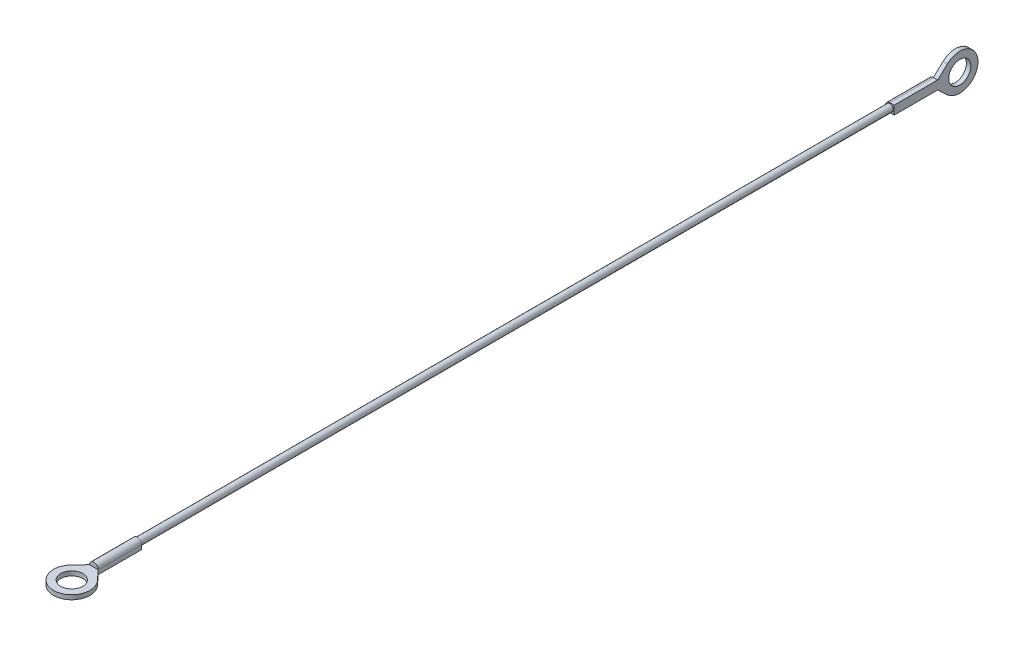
ISO-10303-21;
HEADER;
FILE_DESCRIPTION(('STEP AP214'),'2;1');
FILE_NAME('part.step','',(''),(''),'','','');
FILE_SCHEMA(('AUTOMOTIVE_DESIGN { 1 0 10303 214 1 1 1 1 }'));
ENDSEC;
DATA;
#1=APPLICATION_CONTEXT('core data for automotive mechanical design processes');
#2=APPLICATION_PROTOCOL_DEFINITION('international standard','automotive_design',2000,#1);
#3=PRODUCT_CONTEXT('',#1,'mechanical');
#4=PRODUCT('Part','Part','',(#3));
#5=PRODUCT_RELATED_PRODUCT_CATEGORY('part','',(#4));
#6=PRODUCT_DEFINITION_FORMATION('','',#4);
#7=PRODUCT_DEFINITION_CONTEXT('part definition',#1,'design');
#8=PRODUCT_DEFINITION('design','',#6,#7);
#9=PRODUCT_DEFINITION_SHAPE('','',#8);
#10=(LENGTH_UNIT() NAMED_UNIT(*) SI_UNIT(.MILLI.,.METRE.));
#11=(NAMED_UNIT(*) PLANE_ANGLE_UNIT() SI_UNIT($,.RADIAN.));
#12=(NAMED_UNIT(*) SI_UNIT($,.STERADIAN.) SOLID_ANGLE_UNIT());
#13=UNCERTAINTY_MEASURE_WITH_UNIT(LENGTH_MEASURE(1.E-05),#10,'distance_accuracy_value','');
#14=(GEOMETRIC_REPRESENTATION_CONTEXT(3) GLOBAL_UNCERTAINTY_ASSIGNED_CONTEXT((#13)) GLOBAL_UNIT_ASSIGNED_CONTEXT((#10,
#11,#12)) REPRESENTATION_CONTEXT('',''));
#15=CARTESIAN_POINT('',(0.,0.,0.));
#16=DIRECTION('',(0.,0.,1.));
#17=DIRECTION('',(1.,0.,0.));
#18=AXIS2_PLACEMENT_3D('',#15,#16,#17);
#19=CARTESIAN_POINT('',(0.,0.,-96.52));
#20=DIRECTION('',(0.,0.,-1.));
#21=DIRECTION('',(-1.,0.,0.));
#22=AXIS2_PLACEMENT_3D('',#19,#20,#21);
#23=PLANE('',#22);
#24=CARTESIAN_POINT('',(0.,-0.995,-96.52));
#25=CARTESIAN_POINT('',(-0.411702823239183,-0.995,-96.52));
#26=CARTESIAN_POINT('',(-0.703571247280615,-0.703571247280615,-96.52));
#27=CARTESIAN_POINT('',(-0.994688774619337,-0.412892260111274,-96.52));
#28=CARTESIAN_POINT('',(-0.995,0.,-96.52));
#29=CARTESIAN_POINT('',(-0.995310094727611,0.411392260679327,-96.52));
#30=CARTESIAN_POINT('',(-0.703571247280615,0.703571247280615,-96.52));
#31=CARTESIAN_POINT('',(-0.41258150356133,0.995,-96.52));
#32=CARTESIAN_POINT('',(0.,0.995,-96.52));
#33=B_SPLINE_CURVE_WITH_KNOTS('',2,(#24,#25,#26,#27,#28,#29,#30,#31,#32),.UNSPECIFIED.,.F.,.F.,
(3,2,2,2,3),(0.,0.25,0.5,0.75,1.),.UNSPECIFIED.);
#34=CARTESIAN_POINT('',(-0.00750000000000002,-0.995,-96.52));
#35=VERTEX_POINT('',#34);
#36=CARTESIAN_POINT('',(-0.00750000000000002,0.995,-96.52));
#37=VERTEX_POINT('',#36);
#38=EDGE_CURVE('E180',#35,#37,#33,.T.);
#39=ORIENTED_EDGE('',*,*,#38,.T.);
#40=DIRECTION('',(0.,-1.,0.));
#41=VECTOR('',#40,1.);
#42=CARTESIAN_POINT('',(-0.015,-0.995,-96.52));
#43=LINE('',#42,#41);
#44=EDGE_CURVE('E138',#37,#35,#43,.T.);
#45=ORIENTED_EDGE('',*,*,#44,.T.);
#46=EDGE_LOOP('',(#39,#45));
#47=FACE_BOUND('',#46,.T.);
#48=ADVANCED_FACE('F39',(#47),#23,.T.);
#49=CARTESIAN_POINT('',(0.,0.,96.52));
#50=DIRECTION('',(0.,0.,1.));
#51=DIRECTION('',(1.,0.,0.));
#52=AXIS2_PLACEMENT_3D('',#49,#50,#51);
#53=PLANE('',#52);
#54=CARTESIAN_POINT('',(0.995,0.,96.52));
#55=CARTESIAN_POINT('',(0.995,0.411702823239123,96.52));
#56=CARTESIAN_POINT('',(0.703571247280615,0.703571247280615,96.52));
#57=CARTESIAN_POINT('',(0.412892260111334,0.994688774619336,96.52));
#58=CARTESIAN_POINT('',(0.,0.995,96.52));
#59=CARTESIAN_POINT('',(-0.411392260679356,0.995310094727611,96.52));
#60=CARTESIAN_POINT('',(-0.703571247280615,0.703571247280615,96.52));
#61=CARTESIAN_POINT('',(-0.995,0.412581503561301,96.52));
#62=CARTESIAN_POINT('',(-0.995,0.,96.52));
#63=B_SPLINE_CURVE_WITH_KNOTS('',2,(#54,#55,#56,#57,#58,#59,#60,#61,#62),.UNSPECIFIED.,.F.,.F.,
(3,2,2,2,3),(0.,0.25,0.5,0.75,1.),.UNSPECIFIED.);
#64=CARTESIAN_POINT('',(0.995,0.00749999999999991,96.52));
#65=VERTEX_POINT('',#64);
#66=CARTESIAN_POINT('',(-0.995,0.00749999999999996,96.52));
#67=VERTEX_POINT('',#66);
#68=EDGE_CURVE('E274',#65,#67,#63,.T.);
#69=ORIENTED_EDGE('',*,*,#68,.T.);
#70=DIRECTION('',(1.,0.,0.));
#71=VECTOR('',#70,1.);
#72=CARTESIAN_POINT('',(-0.995,0.015,96.52));
#73=LINE('',#72,#71);
#74=EDGE_CURVE('E228',#67,#65,#73,.T.);
#75=ORIENTED_EDGE('',*,*,#74,.T.);
#76=EDGE_LOOP('',(#69,#75));
#77=FACE_BOUND('',#76,.T.);
#78=ADVANCED_FACE('F251',(#77),#53,.T.);
#79=CARTESIAN_POINT('',(0.,0.,86.52));
#80=DIRECTION('',(0.,0.,-1.));
#81=DIRECTION('',(-1.,0.,0.));
#82=AXIS2_PLACEMENT_3D('',#79,#80,#81);
#83=CYLINDRICAL_SURFACE('',#82,0.795);
#84=CARTESIAN_POINT('',(0.,0.,86.52));
#85=DIRECTION('',(0.,0.,1.));
#86=DIRECTION('',(1.,0.,0.));
#87=AXIS2_PLACEMENT_3D('',#84,#85,#86);
#88=CIRCLE('',#87,0.795);
#89=CARTESIAN_POINT('',(0.795,0.,86.52));
#90=VERTEX_POINT('',#89);
#91=EDGE_CURVE('E11',#90,#90,#88,.T.);
#92=ORIENTED_EDGE('',*,*,#91,.F.);
#93=EDGE_LOOP('',(#92));
#94=FACE_BOUND('',#93,.T.);
#95=CARTESIAN_POINT('',(0.,0.,-86.52));
#96=DIRECTION('',(0.,0.,1.));
#97=DIRECTION('',(1.,0.,0.));
#98=AXIS2_PLACEMENT_3D('',#95,#96,#97);
#99=CIRCLE('',#98,0.795);
#100=CARTESIAN_POINT('',(0.795,0.,-86.52));
#101=VERTEX_POINT('',#100);
#102=EDGE_CURVE('E196',#101,#101,#99,.T.);
#103=ORIENTED_EDGE('',*,*,#102,.T.);
#104=EDGE_LOOP('',(#103));
#105=FACE_BOUND('',#104,.T.);
#106=ADVANCED_FACE('F41',(#94,#105),#83,.T.);
#107=CARTESIAN_POINT('',(0.,0.,96.52));
#108=DIRECTION('',(0.,0.,-1.));
#109=DIRECTION('',(-1.,0.,0.));
#110=AXIS2_PLACEMENT_3D('',#107,#108,#109);
#111=CYLINDRICAL_SURFACE('',#110,0.995);
#112=CARTESIAN_POINT('',(0.,0.,86.52));
#113=DIRECTION('',(0.,0.,1.));
#114=DIRECTION('',(1.,0.,0.));
#115=AXIS2_PLACEMENT_3D('',#112,#113,#114);
#116=CIRCLE('',#115,0.995);
#117=CARTESIAN_POINT('',(0.995,0.,86.52));
#118=VERTEX_POINT('',#117);
#119=CARTESIAN_POINT('',(-0.995,0.,86.52));
#120=VERTEX_POINT('',#119);
#121=EDGE_CURVE('E213',#118,#120,#116,.T.);
#122=ORIENTED_EDGE('',*,*,#121,.T.);
#123=DIRECTION('',(0.,0.,-1.));
#124=VECTOR('',#123,1.);
#125=CARTESIAN_POINT('',(-0.995,0.,96.52));
#126=LINE('',#125,#124);
#127=EDGE_CURVE('E50',#67,#120,#126,.T.);
#128=ORIENTED_EDGE('',*,*,#127,.F.);
#129=ORIENTED_EDGE('',*,*,#68,.F.);
#130=DIRECTION('',(0.,0.,-1.));
#131=VECTOR('',#130,1.);
#132=CARTESIAN_POINT('',(0.995,0.,96.52));
#133=LINE('',#132,#131);
#134=EDGE_CURVE('E402',#65,#118,#133,.T.);
#135=ORIENTED_EDGE('',*,*,#134,.T.);
#136=EDGE_LOOP('',(#122,#128,#129,#135));
#137=FACE_BOUND('',#136,.T.);
#138=ADVANCED_FACE('F280',(#137),#111,.T.);
#139=CARTESIAN_POINT('',(-0.995,0.,96.52));
#140=DIRECTION('',(1.,0.,0.));
#141=DIRECTION('',(0.,1.,0.));
#142=AXIS2_PLACEMENT_3D('',#139,#140,#141);
#143=PLANE('',#142);
#144=DIRECTION('',(0.,-1.,0.));
#145=VECTOR('',#144,1.);
#146=CARTESIAN_POINT('',(-0.995,0.,86.52));
#147=LINE('',#146,#145);
#148=CARTESIAN_POINT('',(-0.995,-0.995,86.52));
#149=VERTEX_POINT('',#148);
#150=EDGE_CURVE('E416',#120,#149,#147,.T.);
#151=ORIENTED_EDGE('',*,*,#150,.T.);
#152=DIRECTION('',(0.,0.,-1.));
#153=VECTOR('',#152,1.);
#154=CARTESIAN_POINT('',(-0.995,-0.995,96.52));
#155=LINE('',#154,#153);
#156=CARTESIAN_POINT('',(-0.995,-0.995,96.52));
#157=VERTEX_POINT('',#156);
#158=EDGE_CURVE('E301',#157,#149,#155,.T.);
#159=ORIENTED_EDGE('',*,*,#158,.F.);
#160=CARTESIAN_POINT('',(-0.994999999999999,0.015,96.52));
#161=DIRECTION('',(0.,-1.,0.));
#162=VECTOR('',#161,1.);
#163=LINE('',#160,#162);
#164=EDGE_CURVE('E222',#67,#157,#163,.T.);
#165=ORIENTED_EDGE('',*,*,#164,.F.);
#166=ORIENTED_EDGE('',*,*,#127,.T.);
#167=EDGE_LOOP('',(#151,#159,#165,#166));
#168=FACE_BOUND('',#167,.T.);
#169=ADVANCED_FACE('F289',(#168),#143,.F.);
#170=CARTESIAN_POINT('',(0.,-0.995,96.52));
#171=DIRECTION('',(0.,1.,0.));
#172=DIRECTION('',(0.,0.,1.));
#173=AXIS2_PLACEMENT_3D('',#170,#171,#172);
#174=PLANE('',#173);
#175=DIRECTION('',(1.,0.,0.));
#176=VECTOR('',#175,1.);
#177=CARTESIAN_POINT('',(0.,-0.995,86.52));
#178=LINE('',#177,#176);
#179=CARTESIAN_POINT('',(0.995,-0.995,86.52));
#180=VERTEX_POINT('',#179);
#181=EDGE_CURVE('E409',#149,#180,#178,.T.);
#182=ORIENTED_EDGE('',*,*,#181,.T.);
#183=DIRECTION('',(0.,0.,-1.));
#184=VECTOR('',#183,1.);
#185=CARTESIAN_POINT('',(0.995,-0.995,96.52));
#186=LINE('',#185,#184);
#187=CARTESIAN_POINT('',(0.995,-0.995,96.52));
#188=VERTEX_POINT('',#187);
#189=EDGE_CURVE('E310',#188,#180,#186,.T.);
#190=ORIENTED_EDGE('',*,*,#189,.F.);
#191=DIRECTION('',(0.681456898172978,0.,0.731858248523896));
#192=VECTOR('',#191,1.);
#193=CARTESIAN_POINT('',(0.995,-0.995,96.52));
#194=LINE('',#193,#192);
#195=CARTESIAN_POINT('',(3.06648606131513,-0.995,98.7446955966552));
#196=VERTEX_POINT('',#195);
#197=EDGE_CURVE('E191',#188,#196,#194,.T.);
#198=ORIENTED_EDGE('',*,*,#197,.T.);
#199=CARTESIAN_POINT('',(0.,-0.995,101.6));
#200=DIRECTION('',(0.,-1.,0.));
#201=DIRECTION('',(0.,0.,-1.));
#202=AXIS2_PLACEMENT_3D('',#199,#200,#201);
#203=CIRCLE('',#202,4.19);
#204=CARTESIAN_POINT('',(-3.06648606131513,-0.995,98.7446955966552));
#205=VERTEX_POINT('',#204);
#206=EDGE_CURVE('E205',#196,#205,#203,.T.);
#207=ORIENTED_EDGE('',*,*,#206,.T.);
#208=DIRECTION('',(0.681456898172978,0.,-0.731858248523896));
#209=VECTOR('',#208,1.);
#210=CARTESIAN_POINT('',(-3.06648606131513,-0.995,98.7446955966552));
#211=LINE('',#210,#209);
#212=EDGE_CURVE('E209',#205,#157,#211,.T.);
#213=ORIENTED_EDGE('',*,*,#212,.T.);
#214=ORIENTED_EDGE('',*,*,#158,.T.);
#215=EDGE_LOOP('',(#182,#190,#198,#207,#213,#214));
#216=FACE_BOUND('',#215,.T.);
#217=CARTESIAN_POINT('',(0.,-0.995,101.6));
#218=DIRECTION('',(0.,-1.,0.));
#219=DIRECTION('',(0.,0.,-1.));
#220=AXIS2_PLACEMENT_3D('',#217,#218,#219);
#221=CIRCLE('',#220,2.53999999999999);
#222=CARTESIAN_POINT('',(0.,-0.995,99.06));
#223=VERTEX_POINT('',#222);
#224=EDGE_CURVE('E192',#223,#223,#221,.T.);
#225=ORIENTED_EDGE('',*,*,#224,.F.);
#226=EDGE_LOOP('',(#225));
#227=FACE_BOUND('',#226,.T.);
#228=ADVANCED_FACE('F293',(#216,#227),#174,.F.);
#229=CARTESIAN_POINT('',(0.995,-0.995,96.52));
#230=DIRECTION('',(-1.,0.,0.));
#231=DIRECTION('',(0.,-1.,0.));
#232=AXIS2_PLACEMENT_3D('',#229,#230,#231);
#233=PLANE('',#232);
#234=DIRECTION('',(0.,1.,0.));
#235=VECTOR('',#234,1.);
#236=CARTESIAN_POINT('',(0.995,-0.995,86.52));
#237=LINE('',#236,#235);
#238=EDGE_CURVE('E408',#180,#118,#237,.T.);
#239=ORIENTED_EDGE('',*,*,#238,.T.);
#240=ORIENTED_EDGE('',*,*,#134,.F.);
#241=DIRECTION('',(0.,1.,0.));
#242=VECTOR('',#241,1.);
#243=CARTESIAN_POINT('',(0.995,-0.995,96.52));
#244=LINE('',#243,#242);
#245=EDGE_CURVE('E278',#188,#65,#244,.T.);
#246=ORIENTED_EDGE('',*,*,#245,.F.);
#247=ORIENTED_EDGE('',*,*,#189,.T.);
#248=EDGE_LOOP('',(#239,#240,#246,#247));
#249=FACE_BOUND('',#248,.T.);
#250=ADVANCED_FACE('F423',(#249),#233,.F.);
#251=CARTESIAN_POINT('',(0.,0.,86.52));
#252=DIRECTION('',(0.,0.,1.));
#253=DIRECTION('',(1.,0.,0.));
#254=AXIS2_PLACEMENT_3D('',#251,#252,#253);
#255=PLANE('',#254);
#256=ORIENTED_EDGE('',*,*,#91,.T.);
#257=EDGE_LOOP('',(#256));
#258=FACE_BOUND('',#257,.T.);
#259=ORIENTED_EDGE('',*,*,#121,.F.);
#260=ORIENTED_EDGE('',*,*,#238,.F.);
#261=ORIENTED_EDGE('',*,*,#181,.F.);
#262=ORIENTED_EDGE('',*,*,#150,.F.);
#263=EDGE_LOOP('',(#259,#260,#261,#262));
#264=FACE_BOUND('',#263,.T.);
#265=ADVANCED_FACE('F241',(#258,#264),#255,.F.);
#266=CARTESIAN_POINT('',(-3.06648606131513,0.015,98.7446955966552));
#267=DIRECTION('',(-0.731858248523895,0.,-0.681456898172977));
#268=DIRECTION('',(-0.681456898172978,0.,0.731858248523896));
#269=AXIS2_PLACEMENT_3D('',#266,#267,#268);
#270=PLANE('',#269);
#271=ORIENTED_EDGE('',*,*,#212,.F.);
#272=DIRECTION('',(0.,-1.,0.));
#273=VECTOR('',#272,1.);
#274=CARTESIAN_POINT('',(-3.06648606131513,0.015,98.7446955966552));
#275=LINE('',#274,#273);
#276=CARTESIAN_POINT('',(-3.06648606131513,0.015,98.7446955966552));
#277=VERTEX_POINT('',#276);
#278=EDGE_CURVE('E210',#277,#205,#275,.T.);
#279=ORIENTED_EDGE('',*,*,#278,.F.);
#280=DIRECTION('',(0.681456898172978,0.,-0.731858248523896));
#281=VECTOR('',#280,1.);
#282=CARTESIAN_POINT('',(-3.06648606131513,0.015,98.7446955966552));
#283=LINE('',#282,#281);
#284=EDGE_CURVE('E201',#277,#67,#283,.T.);
#285=ORIENTED_EDGE('',*,*,#284,.T.);
#286=ORIENTED_EDGE('',*,*,#164,.T.);
#287=EDGE_LOOP('',(#271,#279,#285,#286));
#288=FACE_BOUND('',#287,.T.);
#289=ADVANCED_FACE('F230',(#288),#270,.T.);
#290=CARTESIAN_POINT('',(0.,0.015,101.6));
#291=DIRECTION('',(0.,-1.,0.));
#292=DIRECTION('',(0.,0.,-1.));
#293=AXIS2_PLACEMENT_3D('',#290,#291,#292);
#294=CYLINDRICAL_SURFACE('',#293,4.19);
#295=ORIENTED_EDGE('',*,*,#206,.F.);
#296=DIRECTION('',(0.,-1.,0.));
#297=VECTOR('',#296,1.);
#298=CARTESIAN_POINT('',(3.06648606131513,0.015,98.7446955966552));
#299=LINE('',#298,#297);
#300=CARTESIAN_POINT('',(3.06648606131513,0.015,98.7446955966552));
#301=VERTEX_POINT('',#300);
#302=EDGE_CURVE('E214',#301,#196,#299,.T.);
#303=ORIENTED_EDGE('',*,*,#302,.F.);
#304=CARTESIAN_POINT('',(0.,0.015,101.6));
#305=DIRECTION('',(0.,-1.,0.));
#306=DIRECTION('',(0.,0.,-1.));
#307=AXIS2_PLACEMENT_3D('',#304,#305,#306);
#308=CIRCLE('',#307,4.19);
#309=EDGE_CURVE('E197',#301,#277,#308,.T.);
#310=ORIENTED_EDGE('',*,*,#309,.T.);
#311=ORIENTED_EDGE('',*,*,#278,.T.);
#312=EDGE_LOOP('',(#295,#303,#310,#311));
#313=FACE_BOUND('',#312,.T.);
#314=ADVANCED_FACE('F240',(#313),#294,.T.);
#315=CARTESIAN_POINT('',(0.995,0.015,96.52));
#316=DIRECTION('',(0.731858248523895,0.,-0.681456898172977));
#317=DIRECTION('',(-0.681456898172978,0.,-0.731858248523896));
#318=AXIS2_PLACEMENT_3D('',#315,#316,#317);
#319=PLANE('',#318);
#320=ORIENTED_EDGE('',*,*,#197,.F.);
#321=ORIENTED_EDGE('',*,*,#245,.T.);
#322=DIRECTION('',(0.681456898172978,0.,0.731858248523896));
#323=VECTOR('',#322,1.);
#324=CARTESIAN_POINT('',(0.995,0.015,96.52));
#325=LINE('',#324,#323);
#326=EDGE_CURVE('E58',#65,#301,#325,.T.);
#327=ORIENTED_EDGE('',*,*,#326,.T.);
#328=ORIENTED_EDGE('',*,*,#302,.T.);
#329=EDGE_LOOP('',(#320,#321,#327,#328));
#330=FACE_BOUND('',#329,.T.);
#331=ADVANCED_FACE('F246',(#330),#319,.T.);
#332=CARTESIAN_POINT('',(0.,0.015,101.6));
#333=DIRECTION('',(0.,-1.,0.));
#334=DIRECTION('',(0.,0.,-1.));
#335=AXIS2_PLACEMENT_3D('',#332,#333,#334);
#336=PLANE('',#335);
#337=CARTESIAN_POINT('',(0.,0.015,101.6));
#338=DIRECTION('',(0.,-1.,0.));
#339=DIRECTION('',(0.,0.,-1.));
#340=AXIS2_PLACEMENT_3D('',#337,#338,#339);
#341=CIRCLE('',#340,2.53999999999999);
#342=CARTESIAN_POINT('',(0.,0.015,99.06));
#343=VERTEX_POINT('',#342);
#344=EDGE_CURVE('E187',#343,#343,#341,.T.);
#345=ORIENTED_EDGE('',*,*,#344,.T.);
#346=EDGE_LOOP('',(#345));
#347=FACE_BOUND('',#346,.T.);
#348=ORIENTED_EDGE('',*,*,#74,.F.);
#349=ORIENTED_EDGE('',*,*,#284,.F.);
#350=ORIENTED_EDGE('',*,*,#309,.F.);
#351=ORIENTED_EDGE('',*,*,#326,.F.);
#352=EDGE_LOOP('',(#348,#349,#350,#351));
#353=FACE_BOUND('',#352,.T.);
#354=ADVANCED_FACE('F242',(#347,#353),#336,.F.);
#355=CARTESIAN_POINT('',(0.,0.015,101.6));
#356=DIRECTION('',(0.,-1.,0.));
#357=DIRECTION('',(0.,0.,-1.));
#358=AXIS2_PLACEMENT_3D('',#355,#356,#357);
#359=CYLINDRICAL_SURFACE('',#358,2.53999999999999);
#360=ORIENTED_EDGE('',*,*,#344,.F.);
#361=EDGE_LOOP('',(#360));
#362=FACE_BOUND('',#361,.T.);
#363=ORIENTED_EDGE('',*,*,#224,.T.);
#364=EDGE_LOOP('',(#363));
#365=FACE_BOUND('',#364,.T.);
#366=ADVANCED_FACE('F451',(#362,#365),#359,.F.);
#367=CARTESIAN_POINT('',(0.,0.,-96.52));
#368=DIRECTION('',(0.,0.,1.));
#369=DIRECTION('',(1.,0.,0.));
#370=AXIS2_PLACEMENT_3D('',#367,#368,#369);
#371=CYLINDRICAL_SURFACE('',#370,0.995);
#372=CARTESIAN_POINT('',(0.,0.,-86.52));
#373=DIRECTION('',(0.,0.,-1.));
#374=DIRECTION('',(-1.,0.,0.));
#375=AXIS2_PLACEMENT_3D('',#372,#373,#374);
#376=CIRCLE('',#375,0.995);
#377=CARTESIAN_POINT('',(0.,-0.995,-86.52));
#378=VERTEX_POINT('',#377);
#379=CARTESIAN_POINT('',(0.,0.995,-86.52));
#380=VERTEX_POINT('',#379);
#381=EDGE_CURVE('E167',#378,#380,#376,.T.);
#382=ORIENTED_EDGE('',*,*,#381,.T.);
#383=DIRECTION('',(0.,0.,1.));
#384=VECTOR('',#383,1.);
#385=CARTESIAN_POINT('',(0.,0.995,-96.52));
#386=LINE('',#385,#384);
#387=EDGE_CURVE('E365',#37,#380,#386,.T.);
#388=ORIENTED_EDGE('',*,*,#387,.F.);
#389=ORIENTED_EDGE('',*,*,#38,.F.);
#390=DIRECTION('',(0.,0.,1.));
#391=VECTOR('',#390,1.);
#392=CARTESIAN_POINT('',(0.,-0.995,-96.52));
#393=LINE('',#392,#391);
#394=EDGE_CURVE('E186',#35,#378,#393,.T.);
#395=ORIENTED_EDGE('',*,*,#394,.T.);
#396=EDGE_LOOP('',(#382,#388,#389,#395));
#397=FACE_BOUND('',#396,.T.);
#398=ADVANCED_FACE('F349',(#397),#371,.T.);
#399=CARTESIAN_POINT('',(0.,0.995,-96.52));
#400=DIRECTION('',(0.,-1.,0.));
#401=DIRECTION('',(0.,0.,-1.));
#402=AXIS2_PLACEMENT_3D('',#399,#400,#401);
#403=PLANE('',#402);
#404=DIRECTION('',(1.,0.,0.));
#405=VECTOR('',#404,1.);
#406=CARTESIAN_POINT('',(0.,0.995,-86.52));
#407=LINE('',#406,#405);
#408=CARTESIAN_POINT('',(0.995,0.995,-86.52));
#409=VERTEX_POINT('',#408);
#410=EDGE_CURVE('E171',#380,#409,#407,.T.);
#411=ORIENTED_EDGE('',*,*,#410,.T.);
#412=DIRECTION('',(0.,0.,1.));
#413=VECTOR('',#412,1.);
#414=CARTESIAN_POINT('',(0.995,0.995,-96.52));
#415=LINE('',#414,#413);
#416=CARTESIAN_POINT('',(0.995,0.995,-96.52));
#417=VERTEX_POINT('',#416);
#418=EDGE_CURVE('E185',#417,#409,#415,.T.);
#419=ORIENTED_EDGE('',*,*,#418,.F.);
#420=CARTESIAN_POINT('',(-0.015,0.995,-96.52));
#421=DIRECTION('',(1.,0.,0.));
#422=VECTOR('',#421,1.);
#423=LINE('',#420,#422);
#424=EDGE_CURVE('E385',#37,#417,#423,.T.);
#425=ORIENTED_EDGE('',*,*,#424,.F.);
#426=ORIENTED_EDGE('',*,*,#387,.T.);
#427=EDGE_LOOP('',(#411,#419,#425,#426));
#428=FACE_BOUND('',#427,.T.);
#429=ADVANCED_FACE('F344',(#428),#403,.F.);
#430=CARTESIAN_POINT('',(0.995,0.,-96.52));
#431=DIRECTION('',(-1.,0.,0.));
#432=DIRECTION('',(0.,-1.,0.));
#433=AXIS2_PLACEMENT_3D('',#430,#431,#432);
#434=PLANE('',#433);
#435=DIRECTION('',(0.,-1.,0.));
#436=VECTOR('',#435,1.);
#437=CARTESIAN_POINT('',(0.995,0.,-86.52));
#438=LINE('',#437,#436);
#439=CARTESIAN_POINT('',(0.995,-0.995,-86.52));
#440=VERTEX_POINT('',#439);
#441=EDGE_CURVE('E174',#409,#440,#438,.T.);
#442=ORIENTED_EDGE('',*,*,#441,.T.);
#443=DIRECTION('',(0.,0.,1.));
#444=VECTOR('',#443,1.);
#445=CARTESIAN_POINT('',(0.995,-0.995,-96.52));
#446=LINE('',#445,#444);
#447=CARTESIAN_POINT('',(0.995,-0.995,-96.52));
#448=VERTEX_POINT('',#447);
#449=EDGE_CURVE('E181',#448,#440,#446,.T.);
#450=ORIENTED_EDGE('',*,*,#449,.F.);
#451=DIRECTION('',(0.,-0.681456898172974,-0.731858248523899));
#452=VECTOR('',#451,1.);
#453=CARTESIAN_POINT('',(0.995,-3.06648606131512,-98.7446955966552));
#454=LINE('',#453,#452);
#455=CARTESIAN_POINT('',(0.995,-3.06648606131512,-98.7446955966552));
#456=VERTEX_POINT('',#455);
#457=EDGE_CURVE('E399',#448,#456,#454,.T.);
#458=ORIENTED_EDGE('',*,*,#457,.T.);
#459=CARTESIAN_POINT('',(0.995,0.,-101.6));
#460=DIRECTION('',(1.,0.,0.));
#461=DIRECTION('',(0.,0.,1.));
#462=AXIS2_PLACEMENT_3D('',#459,#460,#461);
#463=CIRCLE('',#462,4.18999999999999);
#464=CARTESIAN_POINT('',(0.995,3.06648606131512,-98.7446955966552));
#465=VERTEX_POINT('',#464);
#466=EDGE_CURVE('E132',#456,#465,#463,.T.);
#467=ORIENTED_EDGE('',*,*,#466,.T.);
#468=DIRECTION('',(0.,-0.681456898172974,0.731858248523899));
#469=VECTOR('',#468,1.);
#470=CARTESIAN_POINT('',(0.995,0.995,-96.52));
#471=LINE('',#470,#469);
#472=EDGE_CURVE('E155',#465,#417,#471,.T.);
#473=ORIENTED_EDGE('',*,*,#472,.T.);
#474=ORIENTED_EDGE('',*,*,#418,.T.);
#475=EDGE_LOOP('',(#442,#450,#458,#467,#473,#474));
#476=FACE_BOUND('',#475,.T.);
#477=CARTESIAN_POINT('',(0.995,0.,-101.6));
#478=DIRECTION('',(1.,0.,0.));
#479=DIRECTION('',(0.,0.,-1.));
#480=AXIS2_PLACEMENT_3D('',#477,#478,#479);
#481=CIRCLE('',#480,2.54);
#482=CARTESIAN_POINT('',(0.995,0.,-104.14));
#483=VERTEX_POINT('',#482);
#484=EDGE_CURVE('E487',#483,#483,#481,.T.);
#485=ORIENTED_EDGE('',*,*,#484,.F.);
#486=EDGE_LOOP('',(#485));
#487=FACE_BOUND('',#486,.T.);
#488=ADVANCED_FACE('F340',(#476,#487),#434,.F.);
#489=CARTESIAN_POINT('',(0.995,-0.995,-96.52));
#490=DIRECTION('',(0.,1.,0.));
#491=DIRECTION('',(0.,0.,1.));
#492=AXIS2_PLACEMENT_3D('',#489,#490,#491);
#493=PLANE('',#492);
#494=DIRECTION('',(-1.,0.,0.));
#495=VECTOR('',#494,1.);
#496=CARTESIAN_POINT('',(0.995,-0.995,-86.52));
#497=LINE('',#496,#495);
#498=EDGE_CURVE('E177',#440,#378,#497,.T.);
#499=ORIENTED_EDGE('',*,*,#498,.T.);
#500=ORIENTED_EDGE('',*,*,#394,.F.);
#501=DIRECTION('',(-1.,0.,0.));
#502=VECTOR('',#501,1.);
#503=CARTESIAN_POINT('',(0.995,-0.995,-96.52));
#504=LINE('',#503,#502);
#505=EDGE_CURVE('E152',#448,#35,#504,.T.);
#506=ORIENTED_EDGE('',*,*,#505,.F.);
#507=ORIENTED_EDGE('',*,*,#449,.T.);
#508=EDGE_LOOP('',(#499,#500,#506,#507));
#509=FACE_BOUND('',#508,.T.);
#510=ADVANCED_FACE('F336',(#509),#493,.F.);
#511=CARTESIAN_POINT('',(0.,0.,-86.52));
#512=DIRECTION('',(0.,0.,-1.));
#513=DIRECTION('',(-1.,0.,0.));
#514=AXIS2_PLACEMENT_3D('',#511,#512,#513);
#515=PLANE('',#514);
#516=ORIENTED_EDGE('',*,*,#102,.F.);
#517=EDGE_LOOP('',(#516));
#518=FACE_BOUND('',#517,.T.);
#519=ORIENTED_EDGE('',*,*,#381,.F.);
#520=ORIENTED_EDGE('',*,*,#498,.F.);
#521=ORIENTED_EDGE('',*,*,#441,.F.);
#522=ORIENTED_EDGE('',*,*,#410,.F.);
#523=EDGE_LOOP('',(#519,#520,#521,#522));
#524=FACE_BOUND('',#523,.T.);
#525=ADVANCED_FACE('F333',(#518,#524),#515,.F.);
#526=CARTESIAN_POINT('',(-0.015,-3.06648606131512,-98.7446955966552));
#527=DIRECTION('',(0.,-0.731858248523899,0.681456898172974));
#528=DIRECTION('',(0.,-0.681456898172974,-0.731858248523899));
#529=AXIS2_PLACEMENT_3D('',#526,#527,#528);
#530=PLANE('',#529);
#531=ORIENTED_EDGE('',*,*,#457,.F.);
#532=ORIENTED_EDGE('',*,*,#505,.T.);
#533=DIRECTION('',(0.,-0.681456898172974,-0.731858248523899));
#534=VECTOR('',#533,1.);
#535=CARTESIAN_POINT('',(-0.015,-3.06648606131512,-98.7446955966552));
#536=LINE('',#535,#534);
#537=CARTESIAN_POINT('',(-0.015,-3.06648606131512,-98.7446955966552));
#538=VERTEX_POINT('',#537);
#539=EDGE_CURVE('E145',#35,#538,#536,.T.);
#540=ORIENTED_EDGE('',*,*,#539,.T.);
#541=DIRECTION('',(1.,0.,0.));
#542=VECTOR('',#541,1.);
#543=CARTESIAN_POINT('',(-0.015,-3.06648606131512,-98.7446955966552));
#544=LINE('',#543,#542);
#545=EDGE_CURVE('E127',#538,#456,#544,.T.);
#546=ORIENTED_EDGE('',*,*,#545,.T.);
#547=EDGE_LOOP('',(#531,#532,#540,#546));
#548=FACE_BOUND('',#547,.T.);
#549=ADVANCED_FACE('F150',(#548),#530,.T.);
#550=CARTESIAN_POINT('',(-0.015,0.995,-96.52));
#551=DIRECTION('',(0.,0.731858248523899,0.681456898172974));
#552=DIRECTION('',(0.,-0.681456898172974,0.731858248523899));
#553=AXIS2_PLACEMENT_3D('',#550,#551,#552);
#554=PLANE('',#553);
#555=ORIENTED_EDGE('',*,*,#472,.F.);
#556=DIRECTION('',(1.,0.,0.));
#557=VECTOR('',#556,1.);
#558=CARTESIAN_POINT('',(-0.015,3.06648606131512,-98.7446955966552));
#559=LINE('',#558,#557);
#560=CARTESIAN_POINT('',(-0.015,3.06648606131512,-98.7446955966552));
#561=VERTEX_POINT('',#560);
#562=EDGE_CURVE('E137',#561,#465,#559,.T.);
#563=ORIENTED_EDGE('',*,*,#562,.F.);
#564=DIRECTION('',(0.,-0.681456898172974,0.731858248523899));
#565=VECTOR('',#564,1.);
#566=CARTESIAN_POINT('',(-0.015,0.995,-96.52));
#567=LINE('',#566,#565);
#568=EDGE_CURVE('E147',#561,#37,#567,.T.);
#569=ORIENTED_EDGE('',*,*,#568,.T.);
#570=ORIENTED_EDGE('',*,*,#424,.T.);
#571=EDGE_LOOP('',(#555,#563,#569,#570));
#572=FACE_BOUND('',#571,.T.);
#573=ADVANCED_FACE('F498',(#572),#554,.T.);
#574=CARTESIAN_POINT('',(-0.015,0.,-101.6));
#575=DIRECTION('',(1.,0.,0.));
#576=DIRECTION('',(0.,0.,-1.));
#577=AXIS2_PLACEMENT_3D('',#574,#575,#576);
#578=CYLINDRICAL_SURFACE('',#577,4.18999999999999);
#579=ORIENTED_EDGE('',*,*,#466,.F.);
#580=ORIENTED_EDGE('',*,*,#545,.F.);
#581=CARTESIAN_POINT('',(-0.015,0.,-101.6));
#582=DIRECTION('',(1.,0.,0.));
#583=DIRECTION('',(0.,0.,1.));
#584=AXIS2_PLACEMENT_3D('',#581,#582,#583);
#585=CIRCLE('',#584,4.18999999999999);
#586=EDGE_CURVE('E130',#538,#561,#585,.T.);
#587=ORIENTED_EDGE('',*,*,#586,.T.);
#588=ORIENTED_EDGE('',*,*,#562,.T.);
#589=EDGE_LOOP('',(#579,#580,#587,#588));
#590=FACE_BOUND('',#589,.T.);
#591=ADVANCED_FACE('F129',(#590),#578,.T.);
#592=CARTESIAN_POINT('',(-0.015,0.,-101.6));
#593=DIRECTION('',(-1.,0.,0.));
#594=DIRECTION('',(0.,0.,1.));
#595=AXIS2_PLACEMENT_3D('',#592,#593,#594);
#596=PLANE('',#595);
#597=CARTESIAN_POINT('',(-0.015,0.,-101.6));
#598=DIRECTION('',(1.,0.,0.));
#599=DIRECTION('',(0.,0.,-1.));
#600=AXIS2_PLACEMENT_3D('',#597,#598,#599);
#601=CIRCLE('',#600,2.54);
#602=CARTESIAN_POINT('',(-0.015,0.,-104.14));
#603=VERTEX_POINT('',#602);
#604=EDGE_CURVE('E483',#603,#603,#601,.T.);
#605=ORIENTED_EDGE('',*,*,#604,.T.);
#606=EDGE_LOOP('',(#605));
#607=FACE_BOUND('',#606,.T.);
#608=ORIENTED_EDGE('',*,*,#539,.F.);
#609=ORIENTED_EDGE('',*,*,#44,.F.);
#610=ORIENTED_EDGE('',*,*,#568,.F.);
#611=ORIENTED_EDGE('',*,*,#586,.F.);
#612=EDGE_LOOP('',(#608,#609,#610,#611));
#613=FACE_BOUND('',#612,.T.);
#614=ADVANCED_FACE('F143',(#607,#613),#596,.T.);
#615=CARTESIAN_POINT('',(-0.015,0.,-101.6));
#616=DIRECTION('',(1.,0.,0.));
#617=DIRECTION('',(0.,0.,-1.));
#618=AXIS2_PLACEMENT_3D('',#615,#616,#617);
#619=CYLINDRICAL_SURFACE('',#618,2.54);
#620=ORIENTED_EDGE('',*,*,#604,.F.);
#621=EDGE_LOOP('',(#620));
#622=FACE_BOUND('',#621,.T.);
#623=ORIENTED_EDGE('',*,*,#484,.T.);
#624=EDGE_LOOP('',(#623));
#625=FACE_BOUND('',#624,.T.);
#626=ADVANCED_FACE('F512',(#622,#625),#619,.F.);
#627=CLOSED_SHELL('',(#48,#78,#106,#138,#169,#228,#250,#265,#289,#314,#331,#354,#366,#398,#429,
#488,#510,#525,#549,#573,#591,#614,#626));
#628=MANIFOLD_SOLID_BREP('B2',#627);
#629=ADVANCED_BREP_SHAPE_REPRESENTATION('',(#18,#628),#14);
#630=SHAPE_DEFINITION_REPRESENTATION(#9,#629);
ENDSEC;
END-ISO-10303-21;
